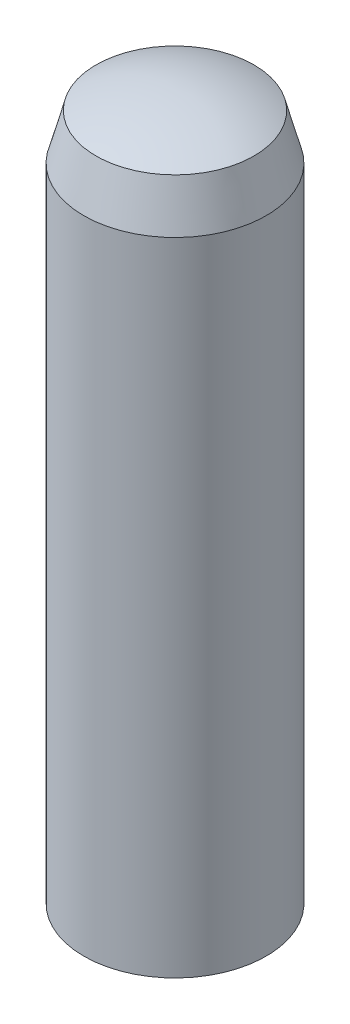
ISO-10303-21;
HEADER;
FILE_DESCRIPTION(('STEP AP214'),'2;1');
FILE_NAME('part.step','',(''),(''),'','','');
FILE_SCHEMA(('AUTOMOTIVE_DESIGN { 1 0 10303 214 1 1 1 1 }'));
ENDSEC;
DATA;
#1=APPLICATION_CONTEXT('core data for automotive mechanical design processes');
#2=APPLICATION_PROTOCOL_DEFINITION('international standard','automotive_design',2000,#1);
#3=PRODUCT_CONTEXT('',#1,'mechanical');
#4=PRODUCT('Part','Part','',(#3));
#5=PRODUCT_RELATED_PRODUCT_CATEGORY('part','',(#4));
#6=PRODUCT_DEFINITION_FORMATION('','',#4);
#7=PRODUCT_DEFINITION_CONTEXT('part definition',#1,'design');
#8=PRODUCT_DEFINITION('design','',#6,#7);
#9=PRODUCT_DEFINITION_SHAPE('','',#8);
#10=(LENGTH_UNIT() NAMED_UNIT(*) SI_UNIT(.MILLI.,.METRE.));
#11=(NAMED_UNIT(*) PLANE_ANGLE_UNIT() SI_UNIT($,.RADIAN.));
#12=(NAMED_UNIT(*) SI_UNIT($,.STERADIAN.) SOLID_ANGLE_UNIT());
#13=UNCERTAINTY_MEASURE_WITH_UNIT(LENGTH_MEASURE(1.E-05),#10,'distance_accuracy_value','');
#14=(GEOMETRIC_REPRESENTATION_CONTEXT(3) GLOBAL_UNCERTAINTY_ASSIGNED_CONTEXT((#13)) GLOBAL_UNIT_ASSIGNED_CONTEXT((#10,
#11,#12)) REPRESENTATION_CONTEXT('',''));
#15=CARTESIAN_POINT('',(0.,0.,0.));
#16=DIRECTION('',(0.,0.,1.));
#17=DIRECTION('',(1.,0.,0.));
#18=AXIS2_PLACEMENT_3D('',#15,#16,#17);
#19=CARTESIAN_POINT('',(0.,5.99999999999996,0.));
#20=DIRECTION('',(0.,0.,1.));
#21=DIRECTION('',(1.,0.,0.));
#22=AXIS2_PLACEMENT_3D('',#19,#20,#21);
#23=SPHERICAL_SURFACE('',#22,6.);
#24=CARTESIAN_POINT('',(0.,5.99999999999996,0.));
#25=DIRECTION('',(0.,-1.,0.));
#26=DIRECTION('',(0.,0.,-1.));
#27=AXIS2_PLACEMENT_3D('',#24,#25,#26);
#28=SPHERICAL_SURFACE('',#27,6.);
#29=CARTESIAN_POINT('',(0.,0.803847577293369,0.));
#30=DIRECTION('',(0.,-1.,0.));
#31=DIRECTION('',(0.,0.,-1.));
#32=AXIS2_PLACEMENT_3D('',#29,#30,#31);
#33=CIRCLE('',#32,3.);
#34=CARTESIAN_POINT('',(0.,0.803847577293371,-3.00000000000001));
#35=VERTEX_POINT('',#34);
#36=EDGE_CURVE('E10',#35,#35,#33,.T.);
#37=ORIENTED_EDGE('',*,*,#36,.T.);
#38=EDGE_LOOP('',(#37));
#39=FACE_BOUND('',#38,.T.);
#40=ADVANCED_FACE('F32',(#39),#28,.T.);
#41=CARTESIAN_POINT('',(0.,0.,0.));
#42=DIRECTION('',(0.,-1.,0.));
#43=DIRECTION('',(0.,0.,-1.));
#44=AXIS2_PLACEMENT_3D('',#41,#42,#43);
#45=CYLINDRICAL_SURFACE('',#44,3.);
#46=CARTESIAN_POINT('',(0.,21.9,0.));
#47=DIRECTION('',(0.,-1.,0.));
#48=DIRECTION('',(0.,0.,-1.));
#49=AXIS2_PLACEMENT_3D('',#46,#47,#48);
#50=CIRCLE('',#49,3.);
#51=CARTESIAN_POINT('',(0.,21.9,-3.00000000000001));
#52=VERTEX_POINT('',#51);
#53=EDGE_CURVE('E38',#52,#52,#50,.T.);
#54=ORIENTED_EDGE('',*,*,#53,.T.);
#55=EDGE_LOOP('',(#54));
#56=FACE_BOUND('',#55,.T.);
#57=ORIENTED_EDGE('',*,*,#36,.F.);
#58=EDGE_LOOP('',(#57));
#59=FACE_BOUND('',#58,.T.);
#60=ADVANCED_FACE('F58',(#56,#59),#45,.T.);
#61=CARTESIAN_POINT('',(0.,21.9,0.));
#62=DIRECTION('',(0.,-1.,0.));
#63=DIRECTION('',(0.,0.,-1.));
#64=AXIS2_PLACEMENT_3D('',#61,#62,#63);
#65=CONICAL_SURFACE('',#64,3.,0.26179938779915);
#66=CARTESIAN_POINT('',(0.,23.4,0.));
#67=DIRECTION('',(0.,-1.,0.));
#68=DIRECTION('',(0.,0.,-1.));
#69=AXIS2_PLACEMENT_3D('',#66,#67,#68);
#70=CIRCLE('',#69,2.59807621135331);
#71=CARTESIAN_POINT('',(0.,23.4,-2.59807621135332));
#72=VERTEX_POINT('',#71);
#73=EDGE_CURVE('E42',#72,#72,#70,.T.);
#74=ORIENTED_EDGE('',*,*,#73,.T.);
#75=EDGE_LOOP('',(#74));
#76=FACE_BOUND('',#75,.T.);
#77=ORIENTED_EDGE('',*,*,#53,.F.);
#78=EDGE_LOOP('',(#77));
#79=FACE_BOUND('',#78,.T.);
#80=ADVANCED_FACE('F49',(#76,#79),#65,.T.);
#81=CARTESIAN_POINT('',(0.,18.075,0.));
#82=DIRECTION('',(0.,0.,1.));
#83=DIRECTION('',(1.,0.,0.));
#84=AXIS2_PLACEMENT_3D('',#81,#82,#83);
#85=SPHERICAL_SURFACE('',#84,5.925);
#86=CARTESIAN_POINT('',(0.,18.075,0.));
#87=DIRECTION('',(0.,-1.,0.));
#88=DIRECTION('',(0.,0.,-1.));
#89=AXIS2_PLACEMENT_3D('',#86,#87,#88);
#90=SPHERICAL_SURFACE('',#89,5.925);
#91=ORIENTED_EDGE('',*,*,#73,.F.);
#92=EDGE_LOOP('',(#91));
#93=FACE_BOUND('',#92,.T.);
#94=ADVANCED_FACE('F52',(#93),#90,.T.);
#95=CLOSED_SHELL('',(#40,#60,#80,#94));
#96=MANIFOLD_SOLID_BREP('B2',#95);
#97=ADVANCED_BREP_SHAPE_REPRESENTATION('',(#18,#96),#14);
#98=SHAPE_DEFINITION_REPRESENTATION(#9,#97);
ENDSEC;
END-ISO-10303-21;
